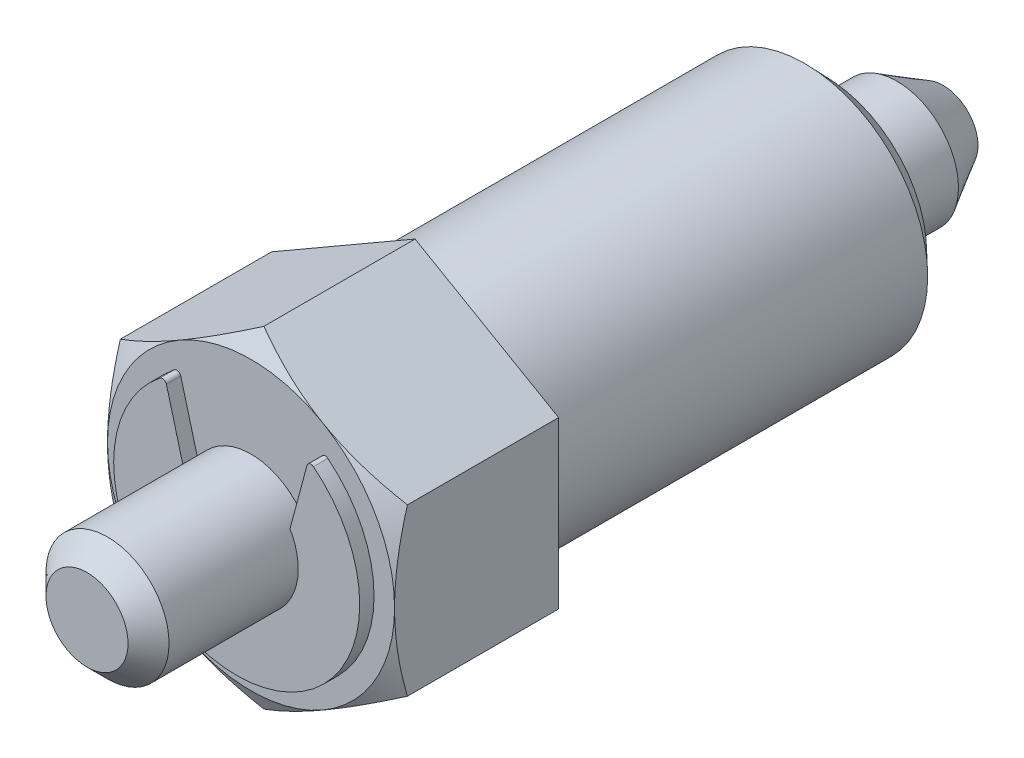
ISO-10303-21;
HEADER;
FILE_DESCRIPTION(('STEP AP214'),'2;1');
FILE_NAME('part.step','',(''),(''),'','','');
FILE_SCHEMA(('AUTOMOTIVE_DESIGN { 1 0 10303 214 1 1 1 1 }'));
ENDSEC;
DATA;
#1=APPLICATION_CONTEXT('core data for automotive mechanical design processes');
#2=APPLICATION_PROTOCOL_DEFINITION('international standard','automotive_design',2000,#1);
#3=PRODUCT_CONTEXT('',#1,'mechanical');
#4=PRODUCT('Part','Part','',(#3));
#5=PRODUCT_RELATED_PRODUCT_CATEGORY('part','',(#4));
#6=PRODUCT_DEFINITION_FORMATION('','',#4);
#7=PRODUCT_DEFINITION_CONTEXT('part definition',#1,'design');
#8=PRODUCT_DEFINITION('design','',#6,#7);
#9=PRODUCT_DEFINITION_SHAPE('','',#8);
#10=(LENGTH_UNIT() NAMED_UNIT(*) SI_UNIT(.MILLI.,.METRE.));
#11=(NAMED_UNIT(*) PLANE_ANGLE_UNIT() SI_UNIT($,.RADIAN.));
#12=(NAMED_UNIT(*) SI_UNIT($,.STERADIAN.) SOLID_ANGLE_UNIT());
#13=UNCERTAINTY_MEASURE_WITH_UNIT(LENGTH_MEASURE(1.E-05),#10,'distance_accuracy_value','');
#14=(GEOMETRIC_REPRESENTATION_CONTEXT(3) GLOBAL_UNCERTAINTY_ASSIGNED_CONTEXT((#13)) GLOBAL_UNIT_ASSIGNED_CONTEXT((#10,
#11,#12)) REPRESENTATION_CONTEXT('',''));
#15=CARTESIAN_POINT('',(0.,0.,0.));
#16=DIRECTION('',(0.,0.,1.));
#17=DIRECTION('',(1.,0.,0.));
#18=AXIS2_PLACEMENT_3D('',#15,#16,#17);
#19=CARTESIAN_POINT('',(2.51950813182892E-10,-1.45456624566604E-10,15.9999999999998));
#20=DIRECTION('',(1.5746925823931E-11,-9.09103903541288E-12,1.));
#21=DIRECTION('',(1.,0.,-1.5746925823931E-11));
#22=AXIS2_PLACEMENT_3D('',#19,#20,#21);
#23=CYLINDRICAL_SURFACE('',#22,2.99999999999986);
#24=CARTESIAN_POINT('',(2.36203887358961E-10,-1.36365585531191E-10,14.9999999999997));
#25=DIRECTION('',(1.5746925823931E-11,-9.09103903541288E-12,1.));
#26=DIRECTION('',(1.,0.,-1.5746925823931E-11));
#27=AXIS2_PLACEMENT_3D('',#24,#25,#26);
#28=CIRCLE('',#27,2.99999999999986);
#29=CARTESIAN_POINT('',(3.00000000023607,-1.36365585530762E-10,14.9999999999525));
#30=VERTEX_POINT('',#29);
#31=EDGE_CURVE('E22',#30,#30,#28,.T.);
#32=ORIENTED_EDGE('',*,*,#31,.F.);
#33=EDGE_LOOP('',(#32));
#34=FACE_BOUND('',#33,.T.);
#35=CARTESIAN_POINT('',(1.369982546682E-10,-7.9092039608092E-11,8.7));
#36=DIRECTION('',(-1.5746925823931E-11,9.09103903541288E-12,-1.));
#37=DIRECTION('',(1.,0.,-1.5746925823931E-11));
#38=AXIS2_PLACEMENT_3D('',#35,#36,#37);
#39=CIRCLE('',#38,3.0000000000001);
#40=CARTESIAN_POINT('',(2.60000000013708,1.49666295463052,8.69999999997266));
#41=VERTEX_POINT('',#40);
#42=CARTESIAN_POINT('',(-2.59999999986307,1.49666295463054,8.70000000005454));
#43=VERTEX_POINT('',#42);
#44=EDGE_CURVE('E580',#41,#43,#39,.T.);
#45=ORIENTED_EDGE('',*,*,#44,.F.);
#46=DIRECTION('',(-1.5746925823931E-11,9.09103903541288E-12,-1.));
#47=VECTOR('',#46,1.);
#48=CARTESIAN_POINT('',(2.60000000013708,1.49666295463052,8.69999999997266));
#49=LINE('',#48,#47);
#50=CARTESIAN_POINT('',(2.60000000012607,1.49666295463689,7.99999999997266));
#51=VERTEX_POINT('',#50);
#52=EDGE_CURVE('E559',#41,#51,#49,.T.);
#53=ORIENTED_EDGE('',*,*,#52,.T.);
#54=CARTESIAN_POINT('',(1.25975406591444E-10,-7.27283122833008E-11,7.99999999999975));
#55=DIRECTION('',(1.5746925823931E-11,-9.09103903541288E-12,1.));
#56=DIRECTION('',(1.,0.,-1.5746925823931E-11));
#57=AXIS2_PLACEMENT_3D('',#54,#55,#56);
#58=CIRCLE('',#57,2.99999999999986);
#59=CARTESIAN_POINT('',(-2.59999999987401,1.4966629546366,8.0000000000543));
#60=VERTEX_POINT('',#59);
#61=EDGE_CURVE('E550',#51,#60,#58,.T.);
#62=ORIENTED_EDGE('',*,*,#61,.T.);
#63=DIRECTION('',(-1.5746925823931E-11,9.09103903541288E-12,-1.));
#64=VECTOR('',#63,1.);
#65=CARTESIAN_POINT('',(-2.59999999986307,1.49666295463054,8.70000000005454));
#66=LINE('',#65,#64);
#67=EDGE_CURVE('E29',#43,#60,#66,.T.);
#68=ORIENTED_EDGE('',*,*,#67,.F.);
#69=EDGE_LOOP('',(#45,#53,#62,#68));
#70=FACE_BOUND('',#69,.T.);
#71=ADVANCED_FACE('F14',(#34,#70),#23,.T.);
#72=CARTESIAN_POINT('',(1.25975406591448E-10,6.99999999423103,8.00000000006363));
#73=DIRECTION('',(1.5746925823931E-11,-9.09103903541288E-12,1.));
#74=DIRECTION('',(1.,0.,-1.5746925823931E-11));
#75=AXIS2_PLACEMENT_3D('',#72,#73,#74);
#76=PLANE('',#75);
#77=CARTESIAN_POINT('',(1.25975406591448E-10,-7.2728312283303E-11,8.));
#78=DIRECTION('',(1.5746925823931E-11,-9.09103903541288E-12,1.));
#79=DIRECTION('',(1.,0.,-1.5746925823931E-11));
#80=AXIS2_PLACEMENT_3D('',#77,#78,#79);
#81=CIRCLE('',#80,6.99999999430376);
#82=CARTESIAN_POINT('',(7.00000000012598,-7.27290634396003E-11,7.99999999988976));
#83=VERTEX_POINT('',#82);
#84=CARTESIAN_POINT('',(3.50000000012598,6.06217782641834,8.));
#85=VERTEX_POINT('',#84);
#86=EDGE_CURVE('E547',#83,#85,#81,.T.);
#87=ORIENTED_EDGE('',*,*,#86,.T.);
#88=CARTESIAN_POINT('',(-3.49999999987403,6.06217782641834,8.00000000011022));
#89=VERTEX_POINT('',#88);
#90=EDGE_CURVE('E546',#85,#89,#81,.T.);
#91=ORIENTED_EDGE('',*,*,#90,.T.);
#92=CARTESIAN_POINT('',(-6.99999999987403,-7.27283122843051E-11,8.00000000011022));
#93=VERTEX_POINT('',#92);
#94=EDGE_CURVE('E545',#89,#93,#81,.T.);
#95=ORIENTED_EDGE('',*,*,#94,.T.);
#96=CARTESIAN_POINT('',(-3.49999999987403,-6.0621778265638,8.));
#97=VERTEX_POINT('',#96);
#98=EDGE_CURVE('E536',#93,#97,#81,.T.);
#99=ORIENTED_EDGE('',*,*,#98,.T.);
#100=CARTESIAN_POINT('',(3.50000000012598,-6.0621778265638,7.99999999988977));
#101=VERTEX_POINT('',#100);
#102=EDGE_CURVE('E533',#97,#101,#81,.T.);
#103=ORIENTED_EDGE('',*,*,#102,.T.);
#104=EDGE_CURVE('E537',#101,#83,#81,.T.);
#105=ORIENTED_EDGE('',*,*,#104,.T.);
#106=EDGE_LOOP('',(#87,#91,#95,#99,#103,#105));
#107=FACE_BOUND('',#106,.T.);
#108=ORIENTED_EDGE('',*,*,#61,.F.);
#109=DIRECTION('',(-0.258819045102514,-0.96592582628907,-4.7056570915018E-12));
#110=VECTOR('',#109,1.);
#111=CARTESIAN_POINT('',(2.60000000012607,1.49666295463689,7.99999999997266));
#112=LINE('',#111,#110);
#113=CARTESIAN_POINT('',(3.42703733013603,4.58320828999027,7.99999999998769));
#114=VERTEX_POINT('',#113);
#115=EDGE_CURVE('E562',#114,#51,#112,.T.);
#116=ORIENTED_EDGE('',*,*,#115,.F.);
#117=CARTESIAN_POINT('',(3.62022249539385,4.53144448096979,7.99999999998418));
#118=DIRECTION('',(1.5746925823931E-11,-9.09103903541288E-12,1.));
#119=DIRECTION('',(1.,0.,-1.5746925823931E-11));
#120=AXIS2_PLACEMENT_3D('',#117,#118,#119);
#121=CIRCLE('',#120,0.19999999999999);
#122=CARTESIAN_POINT('',(3.74505775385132,4.68770118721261,7.99999999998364));
#123=VERTEX_POINT('',#122);
#124=EDGE_CURVE('E564',#123,#114,#121,.T.);
#125=ORIENTED_EDGE('',*,*,#124,.F.);
#126=CARTESIAN_POINT('',(1.25975406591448E-10,-7.2728312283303E-11,8.));
#127=DIRECTION('',(1.5746925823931E-11,-9.09103903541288E-12,1.));
#128=DIRECTION('',(1.,0.,-1.5746925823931E-11));
#129=AXIS2_PLACEMENT_3D('',#126,#127,#128);
#130=CIRCLE('',#129,6.00000000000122);
#131=CARTESIAN_POINT('',(-3.74505775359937,4.6877011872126,8.00000000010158));
#132=VERTEX_POINT('',#131);
#133=EDGE_CURVE('E575',#132,#123,#130,.T.);
#134=ORIENTED_EDGE('',*,*,#133,.F.);
#135=CARTESIAN_POINT('',(-3.62022249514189,4.53144448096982,8.0000000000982));
#136=DIRECTION('',(1.5746925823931E-11,-9.09103903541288E-12,1.));
#137=DIRECTION('',(1.,0.,-1.5746925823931E-11));
#138=AXIS2_PLACEMENT_3D('',#135,#136,#137);
#139=CIRCLE('',#138,0.199999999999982);
#140=CARTESIAN_POINT('',(-3.42703732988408,4.58320828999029,8.00000000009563));
#141=VERTEX_POINT('',#140);
#142=EDGE_CURVE('E144',#141,#132,#139,.T.);
#143=ORIENTED_EDGE('',*,*,#142,.F.);
#144=DIRECTION('',(-0.25881904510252,0.965925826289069,1.2856953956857E-11));
#145=VECTOR('',#144,1.);
#146=CARTESIAN_POINT('',(-2.5999999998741,1.49666295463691,8.00000000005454));
#147=LINE('',#146,#145);
#148=EDGE_CURVE('E140',#60,#141,#147,.T.);
#149=ORIENTED_EDGE('',*,*,#148,.F.);
#150=EDGE_LOOP('',(#108,#116,#125,#134,#143,#149));
#151=FACE_BOUND('',#150,.T.);
#152=ADVANCED_FACE('F283',(#107,#151),#76,.T.);
#153=CARTESIAN_POINT('',(0.,8.08290376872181,7.34828864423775E-11));
#154=DIRECTION('',(-1.5746925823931E-11,9.09103903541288E-12,-1.));
#155=DIRECTION('',(-1.,0.,1.5746925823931E-11));
#156=AXIS2_PLACEMENT_3D('',#153,#154,#155);
#157=PLANE('',#156);
#158=CARTESIAN_POINT('',(0.,0.,-2.4980018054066E-13));
#159=DIRECTION('',(1.5746925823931E-11,-9.09103903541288E-12,1.));
#160=DIRECTION('',(1.,0.,-1.5746925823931E-11));
#161=AXIS2_PLACEMENT_3D('',#158,#159,#160);
#162=CIRCLE('',#161,6.00000000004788);
#163=CARTESIAN_POINT('',(6.00000000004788,0.,-9.47313551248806E-11));
#164=VERTEX_POINT('',#163);
#165=EDGE_CURVE('E551',#164,#164,#162,.T.);
#166=ORIENTED_EDGE('',*,*,#165,.T.);
#167=EDGE_LOOP('',(#166));
#168=FACE_BOUND('',#167,.T.);
#169=DIRECTION('',(0.,1.,9.09103903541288E-12));
#170=VECTOR('',#169,1.);
#171=CARTESIAN_POINT('',(-7.,-4.04145188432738,7.34863558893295E-11));
#172=LINE('',#171,#170);
#173=CARTESIAN_POINT('',(-7.,-4.04145188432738,7.34863558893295E-11));
#174=VERTEX_POINT('',#173);
#175=CARTESIAN_POINT('',(-7.,4.04145188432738,1.46969242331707E-10));
#176=VERTEX_POINT('',#175);
#177=EDGE_CURVE('E154',#174,#176,#172,.T.);
#178=ORIENTED_EDGE('',*,*,#177,.T.);
#179=DIRECTION('',(0.866025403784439,0.5,-9.09171827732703E-12));
#180=VECTOR('',#179,1.);
#181=CARTESIAN_POINT('',(-7.,4.04145188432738,1.46969242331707E-10));
#182=LINE('',#181,#180);
#183=CARTESIAN_POINT('',(0.,8.08290376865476,7.34828864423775E-11));
#184=VERTEX_POINT('',#183);
#185=EDGE_CURVE('E148',#176,#184,#182,.T.);
#186=ORIENTED_EDGE('',*,*,#185,.T.);
#187=DIRECTION('',(0.866025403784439,-0.5,-1.81827573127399E-11));
#188=VECTOR('',#187,1.);
#189=CARTESIAN_POINT('',(0.,8.08290376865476,7.34828864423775E-11));
#190=LINE('',#189,#188);
#191=CARTESIAN_POINT('',(7.00000000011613,4.04145188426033,-7.34863558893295E-11));
#192=VERTEX_POINT('',#191);
#193=EDGE_CURVE('E170',#184,#192,#190,.T.);
#194=ORIENTED_EDGE('',*,*,#193,.T.);
#195=DIRECTION('',(0.,-1.,-9.09103903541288E-12));
#196=VECTOR('',#195,1.);
#197=CARTESIAN_POINT('',(7.,4.04145188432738,-7.34863558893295E-11));
#198=LINE('',#197,#196);
#199=CARTESIAN_POINT('',(7.,-4.04145188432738,-1.46969242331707E-10));
#200=VERTEX_POINT('',#199);
#201=EDGE_CURVE('E167',#192,#200,#198,.T.);
#202=ORIENTED_EDGE('',*,*,#201,.T.);
#203=DIRECTION('',(-0.866025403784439,-0.5,9.09171827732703E-12));
#204=VECTOR('',#203,1.);
#205=CARTESIAN_POINT('',(7.,-4.04145188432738,-1.46969242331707E-10));
#206=LINE('',#205,#204);
#207=CARTESIAN_POINT('',(0.,-8.08290376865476,-7.34828864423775E-11));
#208=VERTEX_POINT('',#207);
#209=EDGE_CURVE('E163',#200,#208,#206,.T.);
#210=ORIENTED_EDGE('',*,*,#209,.T.);
#211=DIRECTION('',(-0.866025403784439,0.5,1.81827573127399E-11));
#212=VECTOR('',#211,1.);
#213=CARTESIAN_POINT('',(0.,-8.08290376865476,-7.34828864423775E-11));
#214=LINE('',#213,#212);
#215=EDGE_CURVE('E159',#208,#174,#214,.T.);
#216=ORIENTED_EDGE('',*,*,#215,.T.);
#217=EDGE_LOOP('',(#178,#186,#194,#202,#210,#216));
#218=FACE_BOUND('',#217,.T.);
#219=ADVANCED_FACE('F281',(#168,#218),#157,.T.);
#220=CARTESIAN_POINT('',(-3.14938516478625E-10,1.81737513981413E-10,-20.0000000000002));
#221=DIRECTION('',(1.5746925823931E-11,-9.09103903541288E-12,1.));
#222=DIRECTION('',(0.,1.,9.09103903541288E-12));
#223=AXIS2_PLACEMENT_3D('',#220,#221,#222);
#224=SPHERICAL_SURFACE('',#223,6.00000000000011);
#225=CARTESIAN_POINT('',(-4.05556328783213E-10,2.34136393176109E-10,-25.7546351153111));
#226=DIRECTION('',(1.5746925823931E-11,-9.09103903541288E-12,1.));
#227=DIRECTION('',(1.,0.,-1.5746925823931E-11));
#228=AXIS2_PLACEMENT_3D('',#225,#226,#227);
#229=CIRCLE('',#228,1.69828580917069);
#230=CARTESIAN_POINT('',(1.69828580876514,2.34136393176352E-10,-25.7546351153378));
#231=VERTEX_POINT('',#230);
#232=EDGE_CURVE('E594',#231,#231,#229,.T.);
#233=ORIENTED_EDGE('',*,*,#232,.F.);
#234=EDGE_LOOP('',(#233));
#235=FACE_BOUND('',#234,.T.);
#236=ADVANCED_FACE('F16',(#235),#224,.T.);
#237=CARTESIAN_POINT('',(2.51950813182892E-10,-1.45456624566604E-10,15.9999999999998));
#238=DIRECTION('',(1.5746925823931E-11,-9.09103903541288E-12,1.));
#239=DIRECTION('',(1.,0.,-1.5746925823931E-11));
#240=AXIS2_PLACEMENT_3D('',#237,#238,#239);
#241=CYLINDRICAL_SURFACE('',#240,6.00000000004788);
#242=CARTESIAN_POINT('',(-2.99191590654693E-10,1.72729741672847E-10,-19.0000000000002));
#243=DIRECTION('',(1.5746925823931E-11,-9.09103903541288E-12,1.));
#244=DIRECTION('',(1.,0.,-1.5746925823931E-11));
#245=AXIS2_PLACEMENT_3D('',#242,#243,#244);
#246=CIRCLE('',#245,6.00000000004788);
#247=CARTESIAN_POINT('',(5.99999999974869,1.72729741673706E-10,-19.0000000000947));
#248=VERTEX_POINT('',#247);
#249=EDGE_CURVE('E583',#248,#248,#246,.T.);
#250=ORIENTED_EDGE('',*,*,#249,.T.);
#251=EDGE_LOOP('',(#250));
#252=FACE_BOUND('',#251,.T.);
#253=ORIENTED_EDGE('',*,*,#165,.F.);
#254=EDGE_LOOP('',(#253));
#255=FACE_BOUND('',#254,.T.);
#256=ADVANCED_FACE('F277',(#252,#255),#241,.T.);
#257=CARTESIAN_POINT('',(-2.99191590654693E-10,1.72729741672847E-10,-19.0000000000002));
#258=DIRECTION('',(1.5746925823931E-11,-9.09103903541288E-12,1.));
#259=DIRECTION('',(1.,0.,-1.5746925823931E-11));
#260=AXIS2_PLACEMENT_3D('',#257,#258,#259);
#261=CONICAL_SURFACE('',#260,6.00000000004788,0.80978357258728);
#262=CARTESIAN_POINT('',(-3.14938516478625E-10,1.8182078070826E-10,-20.0000000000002));
#263=DIRECTION('',(1.5746925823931E-11,-9.09103903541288E-12,1.));
#264=DIRECTION('',(1.,0.,-1.5746925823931E-11));
#265=AXIS2_PLACEMENT_3D('',#262,#263,#264);
#266=CIRCLE('',#265,4.95000000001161);
#267=CARTESIAN_POINT('',(4.94999999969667,1.81820780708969E-10,-20.0000000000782));
#268=VERTEX_POINT('',#267);
#269=EDGE_CURVE('E586',#268,#268,#266,.T.);
#270=ORIENTED_EDGE('',*,*,#269,.T.);
#271=EDGE_LOOP('',(#270));
#272=FACE_BOUND('',#271,.T.);
#273=ORIENTED_EDGE('',*,*,#249,.F.);
#274=EDGE_LOOP('',(#273));
#275=FACE_BOUND('',#274,.T.);
#276=ADVANCED_FACE('F273',(#272,#275),#261,.T.);
#277=CARTESIAN_POINT('',(-3.14938516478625E-10,4.95000000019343,-19.9999999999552));
#278=DIRECTION('',(-1.5746925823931E-11,9.09103903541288E-12,-1.));
#279=DIRECTION('',(-1.,0.,1.5746925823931E-11));
#280=AXIS2_PLACEMENT_3D('',#277,#278,#279);
#281=PLANE('',#280);
#282=CARTESIAN_POINT('',(-3.14938516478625E-10,1.8182078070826E-10,-20.0000000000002));
#283=DIRECTION('',(1.5746925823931E-11,-9.09103903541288E-12,1.));
#284=DIRECTION('',(1.,0.,-1.5746925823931E-11));
#285=AXIS2_PLACEMENT_3D('',#282,#283,#284);
#286=CIRCLE('',#285,2.99999999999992);
#287=CARTESIAN_POINT('',(2.99999999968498,1.81820780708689E-10,-20.0000000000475));
#288=VERTEX_POINT('',#287);
#289=EDGE_CURVE('E589',#288,#288,#286,.T.);
#290=ORIENTED_EDGE('',*,*,#289,.T.);
#291=EDGE_LOOP('',(#290));
#292=FACE_BOUND('',#291,.T.);
#293=ORIENTED_EDGE('',*,*,#269,.F.);
#294=EDGE_LOOP('',(#293));
#295=FACE_BOUND('',#294,.T.);
#296=ADVANCED_FACE('F269',(#292,#295),#281,.T.);
#297=CARTESIAN_POINT('',(2.51950813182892E-10,-1.45456624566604E-10,15.9999999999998));
#298=DIRECTION('',(1.5746925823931E-11,-9.09103903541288E-12,1.));
#299=DIRECTION('',(1.,0.,-1.5746925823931E-11));
#300=AXIS2_PLACEMENT_3D('',#297,#298,#299);
#301=CYLINDRICAL_SURFACE('',#300,2.99999999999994);
#302=CARTESIAN_POINT('',(-3.70052756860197E-10,2.13639417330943E-10,-23.4999999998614));
#303=DIRECTION('',(1.5746925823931E-11,-9.09103903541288E-12,1.));
#304=DIRECTION('',(1.,0.,-1.5746925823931E-11));
#305=AXIS2_PLACEMENT_3D('',#302,#303,#304);
#306=CIRCLE('',#305,3.);
#307=CARTESIAN_POINT('',(2.99999999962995,2.13639417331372E-10,-23.4999999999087));
#308=VERTEX_POINT('',#307);
#309=EDGE_CURVE('E592',#308,#308,#306,.T.);
#310=ORIENTED_EDGE('',*,*,#309,.T.);
#311=EDGE_LOOP('',(#310));
#312=FACE_BOUND('',#311,.T.);
#313=ORIENTED_EDGE('',*,*,#289,.F.);
#314=EDGE_LOOP('',(#313));
#315=FACE_BOUND('',#314,.T.);
#316=ADVANCED_FACE('F265',(#312,#315),#301,.T.);
#317=CARTESIAN_POINT('',(-3.70052756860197E-10,2.13639417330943E-10,-23.4999999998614));
#318=DIRECTION('',(1.5746925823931E-11,-9.09103903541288E-12,1.));
#319=DIRECTION('',(1.,0.,-1.5746925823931E-11));
#320=AXIS2_PLACEMENT_3D('',#317,#318,#319);
#321=CONICAL_SURFACE('',#320,3.,0.523598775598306);
#322=ORIENTED_EDGE('',*,*,#232,.T.);
#323=EDGE_LOOP('',(#322));
#324=FACE_BOUND('',#323,.T.);
#325=ORIENTED_EDGE('',*,*,#309,.F.);
#326=EDGE_LOOP('',(#325));
#327=FACE_BOUND('',#326,.T.);
#328=ADVANCED_FACE('F261',(#324,#327),#321,.T.);
#329=CARTESIAN_POINT('',(-6.99999999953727,4.04145188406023,29.3853532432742));
#330=DIRECTION('',(-0.5,0.866025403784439,1.57465336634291E-11));
#331=DIRECTION('',(-0.866025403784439,-0.5,9.09171827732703E-12));
#332=AXIS2_PLACEMENT_3D('',#329,#330,#331);
#333=PLANE('',#332);
#334=DIRECTION('',(-1.5746925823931E-11,9.09103903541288E-12,-1.));
#335=VECTOR('',#334,1.);
#336=CARTESIAN_POINT('',(4.6273157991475E-10,8.08290376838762,29.3853532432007));
#337=LINE('',#336,#335);
#338=CARTESIAN_POINT('',(0.,8.08290376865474,7.37478521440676));
#339=VERTEX_POINT('',#338);
#340=EDGE_CURVE('E37',#339,#184,#337,.T.);
#341=ORIENTED_EDGE('',*,*,#340,.T.);
#342=ORIENTED_EDGE('',*,*,#185,.F.);
#343=DIRECTION('',(-1.5746925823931E-11,9.09103903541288E-12,-1.));
#344=VECTOR('',#343,1.);
#345=CARTESIAN_POINT('',(-6.99999999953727,4.04145188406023,29.3853532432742));
#346=LINE('',#345,#344);
#347=CARTESIAN_POINT('',(-6.99999999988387,4.04145188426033,7.37478521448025));
#348=VERTEX_POINT('',#347);
#349=EDGE_CURVE('E146',#348,#176,#346,.T.);
#350=ORIENTED_EDGE('',*,*,#349,.F.);
#351=CARTESIAN_POINT('',(0.000200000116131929,8.08301923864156,7.37471854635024));
#352=CARTESIAN_POINT('',(-0.153667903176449,7.99418356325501,7.42600014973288));
#353=CARTESIAN_POINT('',(-0.308109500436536,7.90501666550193,7.4749544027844));
#354=CARTESIAN_POINT('',(-0.618246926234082,7.72595873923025,7.56756720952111));
#355=CARTESIAN_POINT('',(-0.773943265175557,7.63606741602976,7.61122347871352));
#356=CARTESIAN_POINT('',(-1.24352516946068,7.36495417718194,7.73338840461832));
#357=CARTESIAN_POINT('',(-1.55926433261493,7.18266208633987,7.80287443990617));
#358=CARTESIAN_POINT('',(-2.03176224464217,6.90986528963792,7.88435504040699));
#359=CARTESIAN_POINT('',(-2.18710922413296,6.8201756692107,7.90756651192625));
#360=CARTESIAN_POINT('',(-2.49850511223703,6.64039116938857,7.94648878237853));
#361=CARTESIAN_POINT('',(-2.65455395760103,6.55029632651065,7.9622002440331));
#362=CARTESIAN_POINT('',(-2.96692266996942,6.36995016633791,7.98572208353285));
#363=CARTESIAN_POINT('',(-3.12324202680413,6.27969914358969,7.99354142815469));
#364=CARTESIAN_POINT('',(-3.43601650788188,6.09911871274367,8.00111975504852));
#365=CARTESIAN_POINT('',(-3.59247162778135,6.00878930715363,8.00087898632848));
#366=CARTESIAN_POINT('',(-4.02110687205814,5.76131663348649,7.98914026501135));
#367=CARTESIAN_POINT('',(-4.29314668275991,5.60425437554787,7.96943425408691));
#368=CARTESIAN_POINT('',(-4.83541943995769,5.29117305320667,7.90694653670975));
#369=CARTESIAN_POINT('',(-5.10565047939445,5.13515508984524,7.86414347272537));
#370=CARTESIAN_POINT('',(-5.64901454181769,4.82144370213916,7.7571483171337));
#371=CARTESIAN_POINT('',(-5.92207900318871,4.66378986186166,7.69250290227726));
#372=CARTESIAN_POINT('',(-6.46413578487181,4.35083323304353,7.54578392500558));
#373=CARTESIAN_POINT('',(-6.73313504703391,4.19552643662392,7.46374482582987));
#374=CARTESIAN_POINT('',(-7.00019999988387,4.0413364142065,7.37471854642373));
#375=B_SPLINE_CURVE_WITH_KNOTS('',3,(#351,#352,#353,#354,#355,#356,#357,#358,#359,#360,#361,
#362,#363,#364,#365,#366,#367,#368,#369,#370,#371,#372,#373,#374),.UNSPECIFIED.,.F.,.F.,(4,2,2,
2,2,2,2,2,2,2,2,4),(0.,0.554727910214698,1.1096941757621,2.22193274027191,2.76443041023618,
3.30688013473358,3.84871284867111,4.3905288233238,5.3337651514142,6.27787517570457,
7.24292418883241,8.20607866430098),.UNSPECIFIED.);
#376=EDGE_CURVE('E246',#89,#348,#375,.T.);
#377=ORIENTED_EDGE('',*,*,#376,.F.);
#378=EDGE_CURVE('E596',#339,#89,#375,.T.);
#379=ORIENTED_EDGE('',*,*,#378,.F.);
#380=EDGE_LOOP('',(#341,#342,#350,#377,#379));
#381=FACE_BOUND('',#380,.T.);
#382=ADVANCED_FACE('F256',(#381),#333,.T.);
#383=CARTESIAN_POINT('',(-6.99999999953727,-4.04145188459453,29.3853532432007));
#384=DIRECTION('',(-1.,0.,1.5746925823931E-11));
#385=DIRECTION('',(1.5746925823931E-11,-9.09103903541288E-12,1.));
#386=AXIS2_PLACEMENT_3D('',#383,#384,#385);
#387=PLANE('',#386);
#388=ORIENTED_EDGE('',*,*,#349,.T.);
#389=ORIENTED_EDGE('',*,*,#177,.F.);
#390=DIRECTION('',(-1.5746925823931E-11,9.09103903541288E-12,-1.));
#391=VECTOR('',#390,1.);
#392=CARTESIAN_POINT('',(-6.99999999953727,-4.04145188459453,29.3853532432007));
#393=LINE('',#392,#391);
#394=CARTESIAN_POINT('',(-6.99999999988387,-4.04145188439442,7.37478521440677));
#395=VERTEX_POINT('',#394);
#396=EDGE_CURVE('E158',#395,#174,#393,.T.);
#397=ORIENTED_EDGE('',*,*,#396,.F.);
#398=CARTESIAN_POINT('',(-6.99999999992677,-10.7185259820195,4.6503130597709));
#399=CARTESIAN_POINT('',(-6.99999999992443,-10.4111863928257,4.79883652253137));
#400=CARTESIAN_POINT('',(-6.99999999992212,-10.1031201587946,4.94588353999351));
#401=CARTESIAN_POINT('',(-6.99999999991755,-9.48514148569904,5.23618099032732));
#402=CARTESIAN_POINT('',(-6.99999999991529,-9.17522873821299,5.37943076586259));
#403=CARTESIAN_POINT('',(-6.99999999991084,-8.55148999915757,5.66204468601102));
#404=CARTESIAN_POINT('',(-6.99999999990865,-8.23765176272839,5.80138190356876));
#405=CARTESIAN_POINT('',(-6.99999999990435,-7.60739587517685,6.07407147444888));
#406=CARTESIAN_POINT('',(-6.99999999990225,-7.29097835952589,6.20742413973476));
#407=CARTESIAN_POINT('',(-6.99999999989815,-6.65113230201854,6.46813635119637));
#408=CARTESIAN_POINT('',(-6.99999999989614,-6.32766537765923,6.59540222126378));
#409=CARTESIAN_POINT('',(-6.99999999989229,-5.67691706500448,6.83996662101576));
#410=CARTESIAN_POINT('',(-6.99999999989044,-5.3496352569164,6.95726404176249));
#411=CARTESIAN_POINT('',(-6.99999999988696,-4.69140465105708,7.17873933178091));
#412=CARTESIAN_POINT('',(-6.99999999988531,-4.36046534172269,7.28294509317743));
#413=CARTESIAN_POINT('',(-6.9999999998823,-3.69389387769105,7.47485451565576));
#414=CARTESIAN_POINT('',(-6.99999999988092,-3.35826324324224,7.56256339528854));
#415=CARTESIAN_POINT('',(-6.99999999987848,-2.68202380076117,7.71721463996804));
#416=CARTESIAN_POINT('',(-6.99999999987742,-2.34141369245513,7.784151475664));
#417=CARTESIAN_POINT('',(-6.99999999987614,-1.82750129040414,7.86562610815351));
#418=CARTESIAN_POINT('',(-6.99999999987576,-1.65567653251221,7.88963098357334));
#419=CARTESIAN_POINT('',(-6.99999999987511,-1.31122142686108,7.93085821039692));
#420=CARTESIAN_POINT('',(-6.99999999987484,-1.13859116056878,7.94808123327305));
#421=CARTESIAN_POINT('',(-6.99999999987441,-0.793853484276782,7.97528126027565));
#422=CARTESIAN_POINT('',(-6.99999999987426,-0.621749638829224,7.98530325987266));
#423=CARTESIAN_POINT('',(-6.99999999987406,-0.277271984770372,7.99804825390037));
#424=CARTESIAN_POINT('',(-6.99999999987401,-0.104898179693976,8.00077134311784));
#425=CARTESIAN_POINT('',(-6.99999999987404,0.239760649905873,7.99885363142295));
#426=CARTESIAN_POINT('',(-6.99999999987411,0.412045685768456,7.99421489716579));
#427=CARTESIAN_POINT('',(-6.99999999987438,0.756270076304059,7.97768889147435));
#428=CARTESIAN_POINT('',(-6.99999999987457,0.928209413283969,7.96580125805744));
#429=CARTESIAN_POINT('',(-6.99999999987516,1.34493742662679,7.92845253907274));
#430=CARTESIAN_POINT('',(-6.99999999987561,1.58940592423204,7.89935949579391));
#431=CARTESIAN_POINT('',(-6.99999999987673,2.07646957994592,7.82813397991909));
#432=CARTESIAN_POINT('',(-6.99999999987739,2.31906420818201,7.78599794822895));
#433=CARTESIAN_POINT('',(-6.9999999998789,2.80217998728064,7.69018088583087));
#434=CARTESIAN_POINT('',(-6.99999999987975,3.04269895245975,7.63648893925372));
#435=CARTESIAN_POINT('',(-6.9999999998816,3.52126228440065,7.51919825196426));
#436=CARTESIAN_POINT('',(-6.9999999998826,3.75930688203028,7.45560044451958));
#437=CARTESIAN_POINT('',(-6.99999999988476,4.23878446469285,7.31835710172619));
#438=CARTESIAN_POINT('',(-6.99999999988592,4.48015747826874,7.24450348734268));
#439=CARTESIAN_POINT('',(-6.99999999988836,4.96035218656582,7.08949909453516));
#440=CARTESIAN_POINT('',(-6.99999999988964,5.19917551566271,7.00835334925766));
#441=CARTESIAN_POINT('',(-6.99999999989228,5.67331254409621,6.84044083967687));
#442=CARTESIAN_POINT('',(-6.99999999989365,5.90863843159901,6.75370828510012));
#443=CARTESIAN_POINT('',(-6.99999999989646,6.37746440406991,6.57515246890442));
#444=CARTESIAN_POINT('',(-6.99999999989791,6.61096370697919,6.48332714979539));
#445=CARTESIAN_POINT('',(-6.99999999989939,6.84361473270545,6.38945923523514));
#446=B_SPLINE_CURVE_WITH_KNOTS('',3,(#398,#399,#400,#401,#402,#403,#404,#405,#406,#407,#408,
#409,#410,#411,#412,#413,#414,#415,#416,#417,#418,#419,#420,#421,#422,#423,#424,#425,#426,#427,
#428,#429,#430,#431,#432,#433,#434,#435,#436,#437,#438,#439,#440,#441,#442,#443,#444,#445),
.UNSPECIFIED.,.F.,.F.,(4,2,2,2,2,2,2,2,2,2,2,2,2,2,2,2,2,2,2,2,2,2,2,4),(0.,1.02405063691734,
2.04827740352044,3.07836540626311,4.10839964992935,5.15107951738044,6.19387522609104,
7.23441013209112,8.27461532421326,9.31509717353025,9.83546471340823,10.3557807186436,
10.8728165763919,11.3898457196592,11.9067297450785,12.4236395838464,13.1618088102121,
13.900179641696,14.6392510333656,15.378252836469,16.1353691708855,16.8919668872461,
17.6443059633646,18.3969512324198),.UNSPECIFIED.);
#447=EDGE_CURVE('E238',#93,#395,#446,.F.);
#448=ORIENTED_EDGE('',*,*,#447,.F.);
#449=EDGE_CURVE('E245',#348,#93,#446,.F.);
#450=ORIENTED_EDGE('',*,*,#449,.F.);
#451=EDGE_LOOP('',(#388,#389,#397,#448,#450));
#452=FACE_BOUND('',#451,.T.);
#453=ADVANCED_FACE('F253',(#452),#387,.T.);
#454=CARTESIAN_POINT('',(4.62727318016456E-10,-8.0829037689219,29.3853532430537));
#455=DIRECTION('',(-0.5,-0.866025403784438,0.));
#456=DIRECTION('',(0.866025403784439,-0.5,-1.81827573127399E-11));
#457=AXIS2_PLACEMENT_3D('',#454,#455,#456);
#458=PLANE('',#457);
#459=ORIENTED_EDGE('',*,*,#396,.T.);
#460=ORIENTED_EDGE('',*,*,#215,.F.);
#461=DIRECTION('',(-1.5746925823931E-11,9.09103903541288E-12,-1.));
#462=VECTOR('',#461,1.);
#463=CARTESIAN_POINT('',(4.62727318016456E-10,-8.0829037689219,29.3853532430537));
#464=LINE('',#463,#462);
#465=CARTESIAN_POINT('',(1.1612853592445E-10,-8.0829037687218,7.3747852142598));
#466=VERTEX_POINT('',#465);
#467=EDGE_CURVE('E157',#466,#208,#464,.T.);
#468=ORIENTED_EDGE('',*,*,#467,.F.);
#469=CARTESIAN_POINT('',(-7.00019999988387,-4.04133641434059,7.37471854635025));
#470=CARTESIAN_POINT('',(-6.84633209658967,-4.13017208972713,7.42600014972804));
#471=CARTESIAN_POINT('',(-6.69189049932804,-4.21933898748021,7.4749544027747));
#472=CARTESIAN_POINT('',(-6.38175307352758,-4.39839691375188,7.56756720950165));
#473=CARTESIAN_POINT('',(-6.22605673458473,-4.48828823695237,7.61122347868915));
#474=CARTESIAN_POINT('',(-5.75647483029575,-4.75940147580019,7.73338840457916));
#475=CARTESIAN_POINT('',(-5.44073566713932,-4.94169356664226,7.80287443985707));
#476=CARTESIAN_POINT('',(-4.96823775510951,-5.21449036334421,7.88435504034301));
#477=CARTESIAN_POINT('',(-4.81289077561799,-5.30417998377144,7.90756651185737));
#478=CARTESIAN_POINT('',(-4.5014948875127,-5.48396448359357,7.94648878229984));
#479=CARTESIAN_POINT('',(-4.34544604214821,-5.57405932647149,7.9622002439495));
#480=CARTESIAN_POINT('',(-4.03307732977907,-5.75440548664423,7.98572208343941));
#481=CARTESIAN_POINT('',(-3.87675797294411,-5.84465650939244,7.99354142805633));
#482=CARTESIAN_POINT('',(-3.56398349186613,-6.02523694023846,8.00111975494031));
#483=CARTESIAN_POINT('',(-3.40752837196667,-6.11556634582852,8.00087898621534));
#484=CARTESIAN_POINT('',(-2.97889312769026,-6.36303901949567,7.98914026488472));
#485=CARTESIAN_POINT('',(-2.7068533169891,-6.52010127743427,7.9694342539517));
#486=CARTESIAN_POINT('',(-2.16458055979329,-6.83318259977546,7.90694653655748));
#487=CARTESIAN_POINT('',(-1.89434952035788,-6.98920056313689,7.86414347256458));
#488=CARTESIAN_POINT('',(-1.35098545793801,-7.30291195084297,7.75714831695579));
#489=CARTESIAN_POINT('',(-1.07792099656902,-7.46056579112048,7.69250290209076));
#490=CARTESIAN_POINT('',(-0.535864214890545,-7.77352241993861,7.545783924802));
#491=CARTESIAN_POINT('',(-0.266864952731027,-7.92882921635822,7.46374482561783));
#492=CARTESIAN_POINT('',(0.000200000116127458,-8.08301923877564,7.37471854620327));
#493=B_SPLINE_CURVE_WITH_KNOTS('',3,(#469,#470,#471,#472,#473,#474,#475,#476,#477,#478,#479,
#480,#481,#482,#483,#484,#485,#486,#487,#488,#489,#490,#491,#492),.UNSPECIFIED.,.F.,.F.,(4,2,2,
2,2,2,2,2,2,2,2,4),(0.,0.554727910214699,1.1096941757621,2.2219327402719,2.76443041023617,
3.30688013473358,3.84871284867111,4.3905288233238,5.3337651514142,6.27787517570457,
7.24292418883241,8.20607866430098),.UNSPECIFIED.);
#494=EDGE_CURVE('E230',#97,#466,#493,.T.);
#495=ORIENTED_EDGE('',*,*,#494,.F.);
#496=EDGE_CURVE('E237',#395,#97,#493,.T.);
#497=ORIENTED_EDGE('',*,*,#496,.F.);
#498=EDGE_LOOP('',(#459,#460,#468,#495,#497));
#499=FACE_BOUND('',#498,.T.);
#500=ADVANCED_FACE('F217',(#499),#458,.T.);
#501=CARTESIAN_POINT('',(7.00000000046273,-4.04145188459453,29.3853532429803));
#502=DIRECTION('',(0.5,-0.866025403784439,-1.57465336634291E-11));
#503=DIRECTION('',(0.866025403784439,0.5,-9.09171827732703E-12));
#504=AXIS2_PLACEMENT_3D('',#501,#502,#503);
#505=PLANE('',#504);
#506=ORIENTED_EDGE('',*,*,#467,.T.);
#507=ORIENTED_EDGE('',*,*,#209,.F.);
#508=DIRECTION('',(-1.5746925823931E-11,9.09103903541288E-12,-1.));
#509=VECTOR('',#508,1.);
#510=CARTESIAN_POINT('',(7.00000000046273,-4.04145188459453,29.3853532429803));
#511=LINE('',#510,#509);
#512=CARTESIAN_POINT('',(7.00000000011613,-4.04145188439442,7.37478521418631));
#513=VERTEX_POINT('',#512);
#514=EDGE_CURVE('E162',#513,#200,#511,.T.);
#515=ORIENTED_EDGE('',*,*,#514,.F.);
#516=CARTESIAN_POINT('',(-0.000199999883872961,-8.08301923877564,7.37471854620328));
#517=CARTESIAN_POINT('',(0.153667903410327,-7.99418356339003,7.42600014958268));
#518=CARTESIAN_POINT('',(0.308109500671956,-7.90501666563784,7.47495440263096));
#519=CARTESIAN_POINT('',(0.618246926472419,-7.72595873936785,7.56756720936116));
#520=CARTESIAN_POINT('',(0.773943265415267,-7.63606741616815,7.6112234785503));
#521=CARTESIAN_POINT('',(1.24352516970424,-7.36495417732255,7.73338840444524));
#522=CARTESIAN_POINT('',(1.55926433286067,-7.18266208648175,7.80287443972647));
#523=CARTESIAN_POINT('',(2.03176224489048,-6.90986528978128,7.88435504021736));
#524=CARTESIAN_POINT('',(2.187109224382,-6.82017566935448,7.90756651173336));
#525=CARTESIAN_POINT('',(2.49850511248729,-6.64039116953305,7.9464887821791));
#526=CARTESIAN_POINT('',(2.65455395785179,-6.55029632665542,7.96220024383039));
#527=CARTESIAN_POINT('',(2.96692267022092,-6.36995016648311,7.98572208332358));
#528=CARTESIAN_POINT('',(3.12324202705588,-6.27969914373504,7.99354142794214));
#529=CARTESIAN_POINT('',(3.43601650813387,-6.09911871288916,8.00111975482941));
#530=CARTESIAN_POINT('',(3.59247162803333,-6.00878930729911,8.00087898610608));
#531=CARTESIAN_POINT('',(4.02110687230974,-5.76131663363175,7.98914026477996));
#532=CARTESIAN_POINT('',(4.29314668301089,-5.60425437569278,7.9694342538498));
#533=CARTESIAN_POINT('',(4.83541944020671,-5.29117305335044,7.90694653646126));
#534=CARTESIAN_POINT('',(5.10565047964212,-5.13515508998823,7.86414347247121));
#535=CARTESIAN_POINT('',(5.64901454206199,-4.82144370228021,7.75714831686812));
#536=CARTESIAN_POINT('',(5.92207900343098,-4.66378986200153,7.69250290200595));
#537=CARTESIAN_POINT('',(6.46413578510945,-4.35083323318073,7.54578392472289));
#538=CARTESIAN_POINT('',(6.73313504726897,-4.19552643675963,7.46374482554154));
#539=CARTESIAN_POINT('',(7.00020000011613,-4.04133641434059,7.37471854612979));
#540=B_SPLINE_CURVE_WITH_KNOTS('',3,(#516,#517,#518,#519,#520,#521,#522,#523,#524,#525,#526,
#527,#528,#529,#530,#531,#532,#533,#534,#535,#536,#537,#538,#539),.UNSPECIFIED.,.F.,.F.,(4,2,2,
2,2,2,2,2,2,2,2,4),(0.,0.554727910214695,1.10969417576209,2.2219327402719,2.76443041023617,
3.30688013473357,3.8487128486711,4.39052882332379,5.33376515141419,6.27787517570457,
7.2429241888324,8.20607866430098),.UNSPECIFIED.);
#541=EDGE_CURVE('E221',#101,#513,#540,.T.);
#542=ORIENTED_EDGE('',*,*,#541,.F.);
#543=EDGE_CURVE('E228',#466,#101,#540,.T.);
#544=ORIENTED_EDGE('',*,*,#543,.F.);
#545=EDGE_LOOP('',(#506,#507,#515,#542,#544));
#546=FACE_BOUND('',#545,.T.);
#547=ADVANCED_FACE('F212',(#546),#505,.T.);
#548=CARTESIAN_POINT('',(7.00000000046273,4.04145188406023,29.3853532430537));
#549=DIRECTION('',(1.,0.,-1.5746925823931E-11));
#550=DIRECTION('',(0.,1.,9.09103903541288E-12));
#551=AXIS2_PLACEMENT_3D('',#548,#549,#550);
#552=PLANE('',#551);
#553=ORIENTED_EDGE('',*,*,#514,.T.);
#554=ORIENTED_EDGE('',*,*,#201,.F.);
#555=DIRECTION('',(-1.5746925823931E-11,9.09103903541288E-12,-1.));
#556=VECTOR('',#555,1.);
#557=CARTESIAN_POINT('',(7.00000000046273,4.04145188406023,29.3853532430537));
#558=LINE('',#557,#556);
#559=CARTESIAN_POINT('',(7.00000000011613,4.04145188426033,7.37478521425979));
#560=VERTEX_POINT('',#559);
#561=EDGE_CURVE('E166',#560,#192,#558,.T.);
#562=ORIENTED_EDGE('',*,*,#561,.F.);
#563=CARTESIAN_POINT('',(7.00000000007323,-10.7185259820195,4.65031305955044));
#564=CARTESIAN_POINT('',(7.00000000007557,-10.4111863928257,4.79883652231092));
#565=CARTESIAN_POINT('',(7.00000000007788,-10.1031201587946,4.94588353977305));
#566=CARTESIAN_POINT('',(7.00000000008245,-9.48514148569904,5.23618099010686));
#567=CARTESIAN_POINT('',(7.00000000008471,-9.17522873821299,5.37943076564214));
#568=CARTESIAN_POINT('',(7.00000000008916,-8.55148999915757,5.66204468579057));
#569=CARTESIAN_POINT('',(7.00000000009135,-8.23765176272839,5.8013819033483));
#570=CARTESIAN_POINT('',(7.00000000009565,-7.60739587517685,6.07407147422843));
#571=CARTESIAN_POINT('',(7.00000000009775,-7.29097835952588,6.20742413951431));
#572=CARTESIAN_POINT('',(7.00000000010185,-6.65113230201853,6.46813635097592));
#573=CARTESIAN_POINT('',(7.00000000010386,-6.32766537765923,6.59540222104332));
#574=CARTESIAN_POINT('',(7.00000000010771,-5.67691706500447,6.8399666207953));
#575=CARTESIAN_POINT('',(7.00000000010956,-5.3496352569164,6.95726404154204));
#576=CARTESIAN_POINT('',(7.00000000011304,-4.69140465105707,7.17873933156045));
#577=CARTESIAN_POINT('',(7.00000000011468,-4.36046534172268,7.28294509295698));
#578=CARTESIAN_POINT('',(7.00000000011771,-3.69389387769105,7.4748545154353));
#579=CARTESIAN_POINT('',(7.00000000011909,-3.35826324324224,7.56256339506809));
#580=CARTESIAN_POINT('',(7.00000000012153,-2.68202380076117,7.71721463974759));
#581=CARTESIAN_POINT('',(7.00000000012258,-2.34141369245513,7.78415147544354));
#582=CARTESIAN_POINT('',(7.00000000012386,-1.82750129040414,7.86562610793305));
#583=CARTESIAN_POINT('',(7.00000000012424,-1.65567653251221,7.88963098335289));
#584=CARTESIAN_POINT('',(7.00000000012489,-1.31122142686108,7.93085821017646));
#585=CARTESIAN_POINT('',(7.00000000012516,-1.13859116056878,7.94808123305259));
#586=CARTESIAN_POINT('',(7.00000000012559,-0.793853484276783,7.97528126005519));
#587=CARTESIAN_POINT('',(7.00000000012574,-0.621749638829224,7.9853032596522));
#588=CARTESIAN_POINT('',(7.00000000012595,-0.277271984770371,7.99804825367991));
#589=CARTESIAN_POINT('',(7.00000000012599,-0.104898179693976,8.00077134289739));
#590=CARTESIAN_POINT('',(7.00000000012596,0.239760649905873,7.99885363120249));
#591=CARTESIAN_POINT('',(7.00000000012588,0.412045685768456,7.99421489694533));
#592=CARTESIAN_POINT('',(7.00000000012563,0.75627007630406,7.97768889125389));
#593=CARTESIAN_POINT('',(7.00000000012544,0.928209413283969,7.96580125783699));
#594=CARTESIAN_POINT('',(7.00000000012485,1.34493742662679,7.92845253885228));
#595=CARTESIAN_POINT('',(7.00000000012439,1.58940592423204,7.89935949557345));
#596=CARTESIAN_POINT('',(7.00000000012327,2.07646957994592,7.82813397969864));
#597=CARTESIAN_POINT('',(7.00000000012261,2.31906420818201,7.78599794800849));
#598=CARTESIAN_POINT('',(7.0000000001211,2.80217998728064,7.69018088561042));
#599=CARTESIAN_POINT('',(7.00000000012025,3.04269895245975,7.63648893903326));
#600=CARTESIAN_POINT('',(7.0000000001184,3.52126228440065,7.5191982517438));
#601=CARTESIAN_POINT('',(7.0000000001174,3.75930688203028,7.45560044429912));
#602=CARTESIAN_POINT('',(7.00000000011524,4.23878446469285,7.31835710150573));
#603=CARTESIAN_POINT('',(7.00000000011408,4.48015747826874,7.24450348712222));
#604=CARTESIAN_POINT('',(7.00000000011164,4.96035218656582,7.0894990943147));
#605=CARTESIAN_POINT('',(7.00000000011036,5.19917551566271,7.0083533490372));
#606=CARTESIAN_POINT('',(7.00000000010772,5.67331254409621,6.84044083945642));
#607=CARTESIAN_POINT('',(7.00000000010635,5.90863843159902,6.75370828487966));
#608=CARTESIAN_POINT('',(7.00000000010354,6.37746440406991,6.57515246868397));
#609=CARTESIAN_POINT('',(7.0000000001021,6.61096370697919,6.48332714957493));
#610=CARTESIAN_POINT('',(7.00000000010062,6.84361473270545,6.38945923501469));
#611=B_SPLINE_CURVE_WITH_KNOTS('',3,(#563,#564,#565,#566,#567,#568,#569,#570,#571,#572,#573,
#574,#575,#576,#577,#578,#579,#580,#581,#582,#583,#584,#585,#586,#587,#588,#589,#590,#591,#592,
#593,#594,#595,#596,#597,#598,#599,#600,#601,#602,#603,#604,#605,#606,#607,#608,#609,#610),
.UNSPECIFIED.,.F.,.F.,(4,2,2,2,2,2,2,2,2,2,2,2,2,2,2,2,2,2,2,2,2,2,2,4),(0.,1.02405063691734,
2.04827740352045,3.07836540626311,4.10839964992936,5.15107951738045,6.19387522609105,
7.23441013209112,8.27461532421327,9.31509717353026,9.83546471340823,10.3557807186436,
10.8728165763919,11.3898457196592,11.9067297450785,12.4236395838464,13.1618088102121,
13.900179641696,14.6392510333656,15.378252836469,16.1353691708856,16.8919668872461,
17.6443059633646,18.3969512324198),.UNSPECIFIED.);
#612=EDGE_CURVE('E191',#83,#560,#611,.T.);
#613=ORIENTED_EDGE('',*,*,#612,.F.);
#614=EDGE_CURVE('E229',#513,#83,#611,.T.);
#615=ORIENTED_EDGE('',*,*,#614,.F.);
#616=EDGE_LOOP('',(#553,#554,#562,#613,#615));
#617=FACE_BOUND('',#616,.T.);
#618=ADVANCED_FACE('F207',(#617),#552,.T.);
#619=CARTESIAN_POINT('',(4.6273157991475E-10,8.08290376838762,29.3853532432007));
#620=DIRECTION('',(0.5,0.866025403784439,0.));
#621=DIRECTION('',(-0.866025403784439,0.5,1.81827573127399E-11));
#622=AXIS2_PLACEMENT_3D('',#619,#620,#621);
#623=PLANE('',#622);
#624=ORIENTED_EDGE('',*,*,#561,.T.);
#625=ORIENTED_EDGE('',*,*,#193,.F.);
#626=ORIENTED_EDGE('',*,*,#340,.F.);
#627=CARTESIAN_POINT('',(7.00020000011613,4.0413364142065,7.37471854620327));
#628=CARTESIAN_POINT('',(6.84633209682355,4.13017208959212,7.42600014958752));
#629=CARTESIAN_POINT('',(6.69189049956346,4.2193389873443,7.47495440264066));
#630=CARTESIAN_POINT('',(6.38175307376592,4.3983969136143,7.56756720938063));
#631=CARTESIAN_POINT('',(6.22605673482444,4.488288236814,7.61122347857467));
#632=CARTESIAN_POINT('',(5.75647483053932,4.75940147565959,7.7333884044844));
#633=CARTESIAN_POINT('',(5.44073566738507,4.9416935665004,7.80287443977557));
#634=CARTESIAN_POINT('',(4.96823775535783,5.21449036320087,7.88435504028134));
#635=CARTESIAN_POINT('',(4.81289077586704,5.30417998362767,7.90756651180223));
#636=CARTESIAN_POINT('',(4.50149488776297,5.48396448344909,7.94648878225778));
#637=CARTESIAN_POINT('',(4.34544604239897,5.57405932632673,7.96220024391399));
#638=CARTESIAN_POINT('',(4.03307733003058,5.75440548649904,7.98572208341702));
#639=CARTESIAN_POINT('',(3.87675797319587,5.84465650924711,7.9935414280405));
#640=CARTESIAN_POINT('',(3.56398349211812,6.02523694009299,8.00111975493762));
#641=CARTESIAN_POINT('',(3.40752837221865,6.11556634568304,8.00087898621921));
#642=CARTESIAN_POINT('',(2.97889312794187,6.3630390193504,7.98914026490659));
#643=CARTESIAN_POINT('',(2.7068533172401,6.52010127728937,7.969434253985));
#644=CARTESIAN_POINT('',(2.16458056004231,6.83318259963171,7.90694653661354));
#645=CARTESIAN_POINT('',(1.89434952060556,6.98920056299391,7.864143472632));
#646=CARTESIAN_POINT('',(1.35098545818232,7.30291195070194,7.75714831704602));
#647=CARTESIAN_POINT('',(1.07792099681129,7.46056579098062,7.69250290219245));
#648=CARTESIAN_POINT('',(0.535864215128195,7.77352241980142,7.54578392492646));
#649=CARTESIAN_POINT('',(0.266864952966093,7.92882921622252,7.46374482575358));
#650=CARTESIAN_POINT('',(-0.000199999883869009,8.08301923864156,7.37471854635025));
#651=B_SPLINE_CURVE_WITH_KNOTS('',3,(#627,#628,#629,#630,#631,#632,#633,#634,#635,#636,#637,
#638,#639,#640,#641,#642,#643,#644,#645,#646,#647,#648,#649,#650),.UNSPECIFIED.,.F.,.F.,(4,2,2,
2,2,2,2,2,2,2,2,4),(0.,0.554727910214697,1.10969417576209,2.2219327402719,2.76443041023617,
3.30688013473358,3.8487128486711,4.3905288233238,5.33376515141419,6.27787517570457,
7.24292418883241,8.20607866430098),.UNSPECIFIED.);
#652=EDGE_CURVE('E173',#85,#339,#651,.T.);
#653=ORIENTED_EDGE('',*,*,#652,.F.);
#654=EDGE_CURVE('E190',#560,#85,#651,.T.);
#655=ORIENTED_EDGE('',*,*,#654,.F.);
#656=EDGE_LOOP('',(#624,#625,#626,#653,#655));
#657=FACE_BOUND('',#656,.T.);
#658=ADVANCED_FACE('F202',(#657),#623,.T.);
#659=CARTESIAN_POINT('',(2.51950813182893E-10,1.99999999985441,16.000000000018));
#660=DIRECTION('',(1.5746925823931E-11,-9.09103903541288E-12,1.));
#661=DIRECTION('',(1.,0.,-1.5746925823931E-11));
#662=AXIS2_PLACEMENT_3D('',#659,#660,#661);
#663=PLANE('',#662);
#664=CARTESIAN_POINT('',(2.51950813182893E-10,-1.45456624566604E-10,16.));
#665=DIRECTION('',(1.5746925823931E-11,-9.09103903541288E-12,1.));
#666=DIRECTION('',(1.,0.,-1.5746925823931E-11));
#667=AXIS2_PLACEMENT_3D('',#664,#665,#666);
#668=CIRCLE('',#667,1.99999999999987);
#669=CARTESIAN_POINT('',(2.00000000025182,-1.45456624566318E-10,15.9999999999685));
#670=VERTEX_POINT('',#669);
#671=EDGE_CURVE('E9',#670,#670,#668,.T.);
#672=ORIENTED_EDGE('',*,*,#671,.T.);
#673=EDGE_LOOP('',(#672));
#674=FACE_BOUND('',#673,.T.);
#675=ADVANCED_FACE('F206',(#674),#663,.T.);
#676=CARTESIAN_POINT('',(2.51950813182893E-10,-1.45456624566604E-10,16.));
#677=DIRECTION('',(-1.5746925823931E-11,9.09103903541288E-12,-1.));
#678=DIRECTION('',(-1.,0.,1.5746925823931E-11));
#679=AXIS2_PLACEMENT_3D('',#676,#677,#678);
#680=CONICAL_SURFACE('',#679,1.99999999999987,0.785398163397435);
#681=ORIENTED_EDGE('',*,*,#31,.T.);
#682=EDGE_LOOP('',(#681));
#683=FACE_BOUND('',#682,.T.);
#684=ORIENTED_EDGE('',*,*,#671,.F.);
#685=EDGE_LOOP('',(#684));
#686=FACE_BOUND('',#685,.T.);
#687=ADVANCED_FACE('F304',(#683,#686),#680,.T.);
#688=CARTESIAN_POINT('',(1.25975406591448E-10,-7.2728312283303E-11,8.));
#689=DIRECTION('',(-1.5746925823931E-11,9.09103903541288E-12,-1.));
#690=DIRECTION('',(-1.,0.,1.5746925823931E-11));
#691=AXIS2_PLACEMENT_3D('',#688,#689,#690);
#692=CONICAL_SURFACE('',#691,6.99999999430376,1.0471975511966);
#693=ORIENTED_EDGE('',*,*,#104,.F.);
#694=ORIENTED_EDGE('',*,*,#541,.T.);
#695=ORIENTED_EDGE('',*,*,#614,.T.);
#696=EDGE_LOOP('',(#693,#694,#695));
#697=FACE_BOUND('',#696,.T.);
#698=ADVANCED_FACE('F306',(#697),#692,.T.);
#699=ORIENTED_EDGE('',*,*,#102,.F.);
#700=ORIENTED_EDGE('',*,*,#494,.T.);
#701=ORIENTED_EDGE('',*,*,#543,.T.);
#702=EDGE_LOOP('',(#699,#700,#701));
#703=FACE_BOUND('',#702,.T.);
#704=ADVANCED_FACE('F333',(#703),#692,.T.);
#705=ORIENTED_EDGE('',*,*,#98,.F.);
#706=ORIENTED_EDGE('',*,*,#447,.T.);
#707=ORIENTED_EDGE('',*,*,#496,.T.);
#708=EDGE_LOOP('',(#705,#706,#707));
#709=FACE_BOUND('',#708,.T.);
#710=ADVANCED_FACE('F342',(#709),#692,.T.);
#711=ORIENTED_EDGE('',*,*,#94,.F.);
#712=ORIENTED_EDGE('',*,*,#376,.T.);
#713=ORIENTED_EDGE('',*,*,#449,.T.);
#714=EDGE_LOOP('',(#711,#712,#713));
#715=FACE_BOUND('',#714,.T.);
#716=ADVANCED_FACE('F350',(#715),#692,.T.);
#717=ORIENTED_EDGE('',*,*,#86,.F.);
#718=ORIENTED_EDGE('',*,*,#612,.T.);
#719=ORIENTED_EDGE('',*,*,#654,.T.);
#720=EDGE_LOOP('',(#717,#718,#719));
#721=FACE_BOUND('',#720,.T.);
#722=ADVANCED_FACE('F335',(#721),#692,.T.);
#723=ORIENTED_EDGE('',*,*,#652,.T.);
#724=ORIENTED_EDGE('',*,*,#378,.T.);
#725=ORIENTED_EDGE('',*,*,#90,.F.);
#726=EDGE_LOOP('',(#723,#724,#725));
#727=FACE_BOUND('',#726,.T.);
#728=ADVANCED_FACE('F198',(#727),#692,.T.);
#729=CARTESIAN_POINT('',(-3.62022249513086,4.53144448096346,8.7000000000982));
#730=DIRECTION('',(-1.5746925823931E-11,9.09103903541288E-12,-1.));
#731=DIRECTION('',(-1.,0.,1.5746925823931E-11));
#732=AXIS2_PLACEMENT_3D('',#729,#730,#731);
#733=CYLINDRICAL_SURFACE('',#732,0.199999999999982);
#734=ORIENTED_EDGE('',*,*,#142,.T.);
#735=DIRECTION('',(-1.5746925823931E-11,9.09103903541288E-12,-1.));
#736=VECTOR('',#735,1.);
#737=CARTESIAN_POINT('',(-3.74505775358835,4.68770118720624,8.70000000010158));
#738=LINE('',#737,#736);
#739=CARTESIAN_POINT('',(-3.74505775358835,4.68770118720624,8.70000000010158));
#740=VERTEX_POINT('',#739);
#741=EDGE_CURVE('E125',#740,#132,#738,.T.);
#742=ORIENTED_EDGE('',*,*,#741,.F.);
#743=CARTESIAN_POINT('',(-3.62022249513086,4.53144448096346,8.7000000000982));
#744=DIRECTION('',(1.5746925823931E-11,-9.09103903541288E-12,1.));
#745=DIRECTION('',(1.,0.,-1.5746925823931E-11));
#746=AXIS2_PLACEMENT_3D('',#743,#744,#745);
#747=CIRCLE('',#746,0.199999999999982);
#748=CARTESIAN_POINT('',(-3.42703732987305,4.58320828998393,8.70000000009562));
#749=VERTEX_POINT('',#748);
#750=EDGE_CURVE('E132',#749,#740,#747,.T.);
#751=ORIENTED_EDGE('',*,*,#750,.F.);
#752=DIRECTION('',(-1.5746925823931E-11,9.09103903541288E-12,-1.));
#753=VECTOR('',#752,1.);
#754=CARTESIAN_POINT('',(-3.42703732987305,4.58320828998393,8.70000000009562));
#755=LINE('',#754,#753);
#756=EDGE_CURVE('E568',#749,#141,#755,.T.);
#757=ORIENTED_EDGE('',*,*,#756,.T.);
#758=EDGE_LOOP('',(#734,#742,#751,#757));
#759=FACE_BOUND('',#758,.T.);
#760=ADVANCED_FACE('F142',(#759),#733,.T.);
#761=CARTESIAN_POINT('',(1.369982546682E-10,-7.9092039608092E-11,8.7));
#762=DIRECTION('',(-1.5746925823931E-11,9.09103903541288E-12,-1.));
#763=DIRECTION('',(-1.,0.,1.5746925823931E-11));
#764=AXIS2_PLACEMENT_3D('',#761,#762,#763);
#765=CYLINDRICAL_SURFACE('',#764,6.00000000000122);
#766=ORIENTED_EDGE('',*,*,#133,.T.);
#767=DIRECTION('',(-1.5746925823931E-11,9.09103903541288E-12,-1.));
#768=VECTOR('',#767,1.);
#769=CARTESIAN_POINT('',(3.74505775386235,4.68770118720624,8.69999999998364));
#770=LINE('',#769,#768);
#771=CARTESIAN_POINT('',(3.74505775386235,4.68770118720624,8.69999999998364));
#772=VERTEX_POINT('',#771);
#773=EDGE_CURVE('E128',#772,#123,#770,.T.);
#774=ORIENTED_EDGE('',*,*,#773,.F.);
#775=CARTESIAN_POINT('',(1.369982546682E-10,-7.9092039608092E-11,8.7));
#776=DIRECTION('',(1.5746925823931E-11,-9.09103903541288E-12,1.));
#777=DIRECTION('',(1.,0.,-1.5746925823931E-11));
#778=AXIS2_PLACEMENT_3D('',#775,#776,#777);
#779=CIRCLE('',#778,6.00000000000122);
#780=EDGE_CURVE('E121',#740,#772,#779,.T.);
#781=ORIENTED_EDGE('',*,*,#780,.F.);
#782=ORIENTED_EDGE('',*,*,#741,.T.);
#783=EDGE_LOOP('',(#766,#774,#781,#782));
#784=FACE_BOUND('',#783,.T.);
#785=ADVANCED_FACE('F123',(#784),#765,.T.);
#786=CARTESIAN_POINT('',(3.62022249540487,4.53144448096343,8.69999999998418));
#787=DIRECTION('',(-1.5746925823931E-11,9.09103903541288E-12,-1.));
#788=DIRECTION('',(-1.,0.,1.5746925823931E-11));
#789=AXIS2_PLACEMENT_3D('',#786,#787,#788);
#790=CYLINDRICAL_SURFACE('',#789,0.19999999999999);
#791=ORIENTED_EDGE('',*,*,#124,.T.);
#792=DIRECTION('',(-1.5746925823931E-11,9.09103903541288E-12,-1.));
#793=VECTOR('',#792,1.);
#794=CARTESIAN_POINT('',(3.42703733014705,4.5832082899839,8.69999999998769));
#795=LINE('',#794,#793);
#796=CARTESIAN_POINT('',(3.42703733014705,4.5832082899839,8.69999999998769));
#797=VERTEX_POINT('',#796);
#798=EDGE_CURVE('E150',#797,#114,#795,.T.);
#799=ORIENTED_EDGE('',*,*,#798,.F.);
#800=CARTESIAN_POINT('',(3.62022249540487,4.53144448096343,8.69999999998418));
#801=DIRECTION('',(1.5746925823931E-11,-9.09103903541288E-12,1.));
#802=DIRECTION('',(1.,0.,-1.5746925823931E-11));
#803=AXIS2_PLACEMENT_3D('',#800,#801,#802);
#804=CIRCLE('',#803,0.19999999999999);
#805=EDGE_CURVE('E131',#772,#797,#804,.T.);
#806=ORIENTED_EDGE('',*,*,#805,.F.);
#807=ORIENTED_EDGE('',*,*,#773,.T.);
#808=EDGE_LOOP('',(#791,#799,#806,#807));
#809=FACE_BOUND('',#808,.T.);
#810=ADVANCED_FACE('F385',(#809),#790,.T.);
#811=CARTESIAN_POINT('',(2.60000000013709,1.49666295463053,8.69999999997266));
#812=DIRECTION('',(0.96592582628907,-0.258819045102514,-1.75632963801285E-11));
#813=DIRECTION('',(0.258819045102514,0.96592582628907,0.));
#814=AXIS2_PLACEMENT_3D('',#811,#812,#813);
#815=PLANE('',#814);
#816=ORIENTED_EDGE('',*,*,#115,.T.);
#817=ORIENTED_EDGE('',*,*,#52,.F.);
#818=DIRECTION('',(-0.258819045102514,-0.96592582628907,-4.7056570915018E-12));
#819=VECTOR('',#818,1.);
#820=CARTESIAN_POINT('',(2.60000000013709,1.49666295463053,8.69999999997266));
#821=LINE('',#820,#819);
#822=EDGE_CURVE('E574',#797,#41,#821,.T.);
#823=ORIENTED_EDGE('',*,*,#822,.F.);
#824=ORIENTED_EDGE('',*,*,#798,.T.);
#825=EDGE_LOOP('',(#816,#817,#823,#824));
#826=FACE_BOUND('',#825,.T.);
#827=ADVANCED_FACE('F392',(#826),#815,.F.);
#828=CARTESIAN_POINT('',(-2.59999999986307,1.49666295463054,8.70000000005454));
#829=DIRECTION('',(-0.965925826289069,-0.25881904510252,1.28574282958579E-11));
#830=DIRECTION('',(0.25881904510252,-0.965925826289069,0.));
#831=AXIS2_PLACEMENT_3D('',#828,#829,#830);
#832=PLANE('',#831);
#833=ORIENTED_EDGE('',*,*,#148,.T.);
#834=ORIENTED_EDGE('',*,*,#756,.F.);
#835=DIRECTION('',(-0.25881904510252,0.965925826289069,1.2856953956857E-11));
#836=VECTOR('',#835,1.);
#837=CARTESIAN_POINT('',(-2.59999999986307,1.49666295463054,8.70000000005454));
#838=LINE('',#837,#836);
#839=EDGE_CURVE('E136',#43,#749,#838,.T.);
#840=ORIENTED_EDGE('',*,*,#839,.F.);
#841=ORIENTED_EDGE('',*,*,#67,.T.);
#842=EDGE_LOOP('',(#833,#834,#840,#841));
#843=FACE_BOUND('',#842,.T.);
#844=ADVANCED_FACE('F401',(#843),#832,.F.);
#845=CARTESIAN_POINT('',(-3.62022249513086,4.53144448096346,8.7000000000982));
#846=DIRECTION('',(1.5746925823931E-11,-9.09103903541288E-12,1.));
#847=DIRECTION('',(1.,0.,-1.5746925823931E-11));
#848=AXIS2_PLACEMENT_3D('',#845,#846,#847);
#849=PLANE('',#848);
#850=ORIENTED_EDGE('',*,*,#750,.T.);
#851=ORIENTED_EDGE('',*,*,#780,.T.);
#852=ORIENTED_EDGE('',*,*,#805,.T.);
#853=ORIENTED_EDGE('',*,*,#822,.T.);
#854=ORIENTED_EDGE('',*,*,#44,.T.);
#855=ORIENTED_EDGE('',*,*,#839,.T.);
#856=EDGE_LOOP('',(#850,#851,#852,#853,#854,#855));
#857=FACE_BOUND('',#856,.T.);
#858=ADVANCED_FACE('F135',(#857),#849,.T.);
#859=CLOSED_SHELL('',(#71,#152,#219,#236,#256,#276,#296,#316,#328,#382,#453,#500,#547,#618,#658,
#675,#687,#698,#704,#710,#716,#722,#728,#760,#785,#810,#827,#844,#858));
#860=MANIFOLD_SOLID_BREP('B1',#859);
#861=ADVANCED_BREP_SHAPE_REPRESENTATION('',(#18,#860),#14);
#862=SHAPE_DEFINITION_REPRESENTATION(#9,#861);
ENDSEC;
END-ISO-10303-21;
